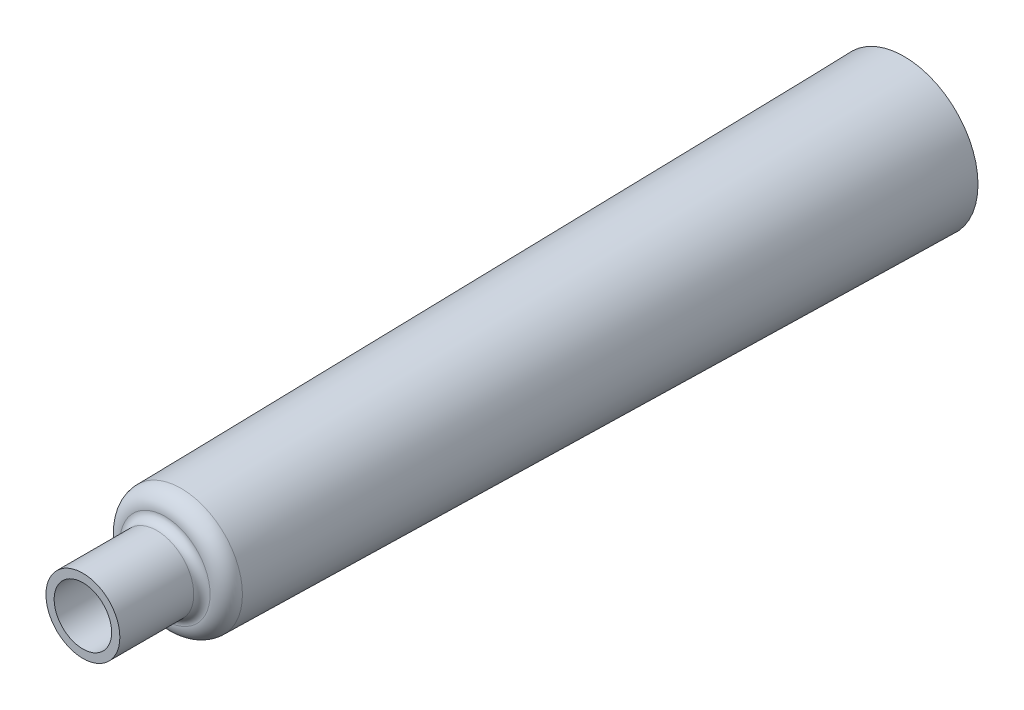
ISO-10303-21;
HEADER;
FILE_DESCRIPTION(('STEP AP214'),'2;1');
FILE_NAME('part.step','',(''),(''),'','','');
FILE_SCHEMA(('AUTOMOTIVE_DESIGN { 1 0 10303 214 1 1 1 1 }'));
ENDSEC;
DATA;
#1=APPLICATION_CONTEXT('core data for automotive mechanical design processes');
#2=APPLICATION_PROTOCOL_DEFINITION('international standard','automotive_design',2000,#1);
#3=PRODUCT_CONTEXT('',#1,'mechanical');
#4=PRODUCT('Part','Part','',(#3));
#5=PRODUCT_RELATED_PRODUCT_CATEGORY('part','',(#4));
#6=PRODUCT_DEFINITION_FORMATION('','',#4);
#7=PRODUCT_DEFINITION_CONTEXT('part definition',#1,'design');
#8=PRODUCT_DEFINITION('design','',#6,#7);
#9=PRODUCT_DEFINITION_SHAPE('','',#8);
#10=(LENGTH_UNIT() NAMED_UNIT(*) SI_UNIT(.MILLI.,.METRE.));
#11=(NAMED_UNIT(*) PLANE_ANGLE_UNIT() SI_UNIT($,.RADIAN.));
#12=(NAMED_UNIT(*) SI_UNIT($,.STERADIAN.) SOLID_ANGLE_UNIT());
#13=UNCERTAINTY_MEASURE_WITH_UNIT(LENGTH_MEASURE(1.E-05),#10,'distance_accuracy_value','');
#14=(GEOMETRIC_REPRESENTATION_CONTEXT(3) GLOBAL_UNCERTAINTY_ASSIGNED_CONTEXT((#13)) GLOBAL_UNIT_ASSIGNED_CONTEXT((#10,
#11,#12)) REPRESENTATION_CONTEXT('',''));
#15=CARTESIAN_POINT('',(0.,0.,0.));
#16=DIRECTION('',(0.,0.,1.));
#17=DIRECTION('',(1.,0.,0.));
#18=AXIS2_PLACEMENT_3D('',#15,#16,#17);
#19=CARTESIAN_POINT('',(0.,0.,0.));
#20=DIRECTION('',(0.,0.,-1.));
#21=DIRECTION('',(1.,0.,0.));
#22=AXIS2_PLACEMENT_3D('',#19,#20,#21);
#23=CONICAL_SURFACE('',#22,9.,0.0174532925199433);
#24=CARTESIAN_POINT('',(0.,0.,88.0349048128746));
#25=DIRECTION('',(0.,0.,-1.));
#26=DIRECTION('',(-1.,0.,0.));
#27=AXIS2_PLACEMENT_3D('',#24,#25,#26);
#28=CIRCLE('',#27,7.46334502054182);
#29=CARTESIAN_POINT('',(-7.46334502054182,0.,88.0349048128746));
#30=VERTEX_POINT('',#29);
#31=EDGE_CURVE('E41',#30,#30,#28,.T.);
#32=ORIENTED_EDGE('',*,*,#31,.T.);
#33=EDGE_LOOP('',(#32));
#34=FACE_BOUND('',#33,.T.);
#35=CARTESIAN_POINT('',(0.,0.,0.));
#36=DIRECTION('',(0.,0.,1.));
#37=DIRECTION('',(1.,0.,0.));
#38=AXIS2_PLACEMENT_3D('',#35,#36,#37);
#39=CIRCLE('',#38,9.);
#40=CARTESIAN_POINT('',(9.,0.,0.));
#41=VERTEX_POINT('',#40);
#42=EDGE_CURVE('E45',#41,#41,#39,.T.);
#43=ORIENTED_EDGE('',*,*,#42,.T.);
#44=EDGE_LOOP('',(#43));
#45=FACE_BOUND('',#44,.T.);
#46=ADVANCED_FACE('F30',(#34,#45),#23,.T.);
#47=CARTESIAN_POINT('',(0.,0.,0.));
#48=DIRECTION('',(0.,0.,1.));
#49=DIRECTION('',(1.,0.,0.));
#50=AXIS2_PLACEMENT_3D('',#47,#48,#49);
#51=PLANE('',#50);
#52=ORIENTED_EDGE('',*,*,#42,.F.);
#53=EDGE_LOOP('',(#52));
#54=FACE_BOUND('',#53,.T.);
#55=ADVANCED_FACE('F87',(#54),#51,.F.);
#56=CARTESIAN_POINT('',(0.,0.,100.));
#57=DIRECTION('',(0.,0.,-1.));
#58=DIRECTION('',(-1.,0.,0.));
#59=AXIS2_PLACEMENT_3D('',#56,#57,#58);
#60=CYLINDRICAL_SURFACE('',#59,4.5);
#61=CARTESIAN_POINT('',(0.,0.,90.9997797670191));
#62=DIRECTION('',(0.,0.,1.));
#63=DIRECTION('',(1.,0.,0.));
#64=AXIS2_PLACEMENT_3D('',#61,#62,#63);
#65=CIRCLE('',#64,4.5);
#66=CARTESIAN_POINT('',(4.5,0.,90.9997797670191));
#67=VERTEX_POINT('',#66);
#68=EDGE_CURVE('E37',#67,#67,#65,.T.);
#69=ORIENTED_EDGE('',*,*,#68,.T.);
#70=EDGE_LOOP('',(#69));
#71=FACE_BOUND('',#70,.T.);
#72=CARTESIAN_POINT('',(0.,0.,100.));
#73=DIRECTION('',(0.,0.,1.));
#74=DIRECTION('',(1.,0.,0.));
#75=AXIS2_PLACEMENT_3D('',#72,#73,#74);
#76=CIRCLE('',#75,4.5);
#77=CARTESIAN_POINT('',(4.5,0.,100.));
#78=VERTEX_POINT('',#77);
#79=EDGE_CURVE('E50',#78,#78,#76,.T.);
#80=ORIENTED_EDGE('',*,*,#79,.F.);
#81=EDGE_LOOP('',(#80));
#82=FACE_BOUND('',#81,.T.);
#83=ADVANCED_FACE('F93',(#71,#82),#60,.T.);
#84=CARTESIAN_POINT('',(0.,0.,100.));
#85=DIRECTION('',(0.,0.,1.));
#86=DIRECTION('',(1.,0.,0.));
#87=AXIS2_PLACEMENT_3D('',#84,#85,#86);
#88=PLANE('',#87);
#89=CARTESIAN_POINT('',(0.,0.,100.));
#90=DIRECTION('',(0.,0.,1.));
#91=DIRECTION('',(1.,0.,0.));
#92=AXIS2_PLACEMENT_3D('',#89,#90,#91);
#93=CIRCLE('',#92,3.5);
#94=CARTESIAN_POINT('',(3.5,0.,100.));
#95=VERTEX_POINT('',#94);
#96=EDGE_CURVE('E54',#95,#95,#93,.T.);
#97=ORIENTED_EDGE('',*,*,#96,.F.);
#98=EDGE_LOOP('',(#97));
#99=FACE_BOUND('',#98,.T.);
#100=ORIENTED_EDGE('',*,*,#79,.T.);
#101=EDGE_LOOP('',(#100));
#102=FACE_BOUND('',#101,.T.);
#103=ADVANCED_FACE('F100',(#99,#102),#88,.T.);
#104=CARTESIAN_POINT('',(0.,0.,88.));
#105=DIRECTION('',(0.,0.,1.));
#106=DIRECTION('',(1.,0.,0.));
#107=AXIS2_PLACEMENT_3D('',#104,#105,#106);
#108=TOROIDAL_SURFACE('',#107,5.46364963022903,2.);
#109=CARTESIAN_POINT('',(0.,0.,89.9998531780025));
#110=DIRECTION('',(0.,0.,-1.));
#111=DIRECTION('',(-1.,0.,0.));
#112=AXIS2_PLACEMENT_3D('',#109,#110,#111);
#113=CIRCLE('',#112,5.48788321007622);
#114=CARTESIAN_POINT('',(-5.48788321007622,0.,89.9998531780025));
#115=VERTEX_POINT('',#114);
#116=EDGE_CURVE('E10',#115,#115,#113,.T.);
#117=ORIENTED_EDGE('',*,*,#116,.T.);
#118=EDGE_LOOP('',(#117));
#119=FACE_BOUND('',#118,.T.);
#120=ORIENTED_EDGE('',*,*,#31,.F.);
#121=EDGE_LOOP('',(#120));
#122=FACE_BOUND('',#121,.T.);
#123=ADVANCED_FACE('F98',(#119,#122),#108,.T.);
#124=CARTESIAN_POINT('',(0.,0.,90.9997797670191));
#125=DIRECTION('',(0.,0.,1.));
#126=DIRECTION('',(1.,0.,0.));
#127=AXIS2_PLACEMENT_3D('',#124,#125,#126);
#128=TOROIDAL_SURFACE('',#127,5.5,1.);
#129=ORIENTED_EDGE('',*,*,#116,.F.);
#130=EDGE_LOOP('',(#129));
#131=FACE_BOUND('',#130,.T.);
#132=ORIENTED_EDGE('',*,*,#68,.F.);
#133=EDGE_LOOP('',(#132));
#134=FACE_BOUND('',#133,.T.);
#135=ADVANCED_FACE('F32',(#131,#134),#128,.F.);
#136=CARTESIAN_POINT('',(0.,0.,-0.0174524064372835));
#137=DIRECTION('',(0.,0.,-1.));
#138=DIRECTION('',(1.,0.,0.));
#139=AXIS2_PLACEMENT_3D('',#136,#137,#138);
#140=CONICAL_SURFACE('',#139,8.00015230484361,0.0174532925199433);
#141=CARTESIAN_POINT('',(0.,0.,88.0174524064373));
#142=DIRECTION('',(0.,0.,-1.));
#143=DIRECTION('',(-1.,0.,0.));
#144=AXIS2_PLACEMENT_3D('',#141,#142,#143);
#145=CIRCLE('',#144,6.46349732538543);
#146=CARTESIAN_POINT('',(-6.46349732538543,0.,88.0174524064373));
#147=VERTEX_POINT('',#146);
#148=EDGE_CURVE('E61',#147,#147,#145,.T.);
#149=ORIENTED_EDGE('',*,*,#148,.F.);
#150=EDGE_LOOP('',(#149));
#151=FACE_BOUND('',#150,.T.);
#152=CARTESIAN_POINT('',(0.,0.,1.));
#153=DIRECTION('',(0.,0.,1.));
#154=DIRECTION('',(1.,0.,0.));
#155=AXIS2_PLACEMENT_3D('',#152,#153,#154);
#156=CIRCLE('',#155,7.98239260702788);
#157=CARTESIAN_POINT('',(7.98239260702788,0.,1.));
#158=VERTEX_POINT('',#157);
#159=EDGE_CURVE('E57',#158,#158,#156,.T.);
#160=ORIENTED_EDGE('',*,*,#159,.F.);
#161=EDGE_LOOP('',(#160));
#162=FACE_BOUND('',#161,.T.);
#163=ADVANCED_FACE('F71',(#151,#162),#140,.F.);
#164=CARTESIAN_POINT('',(0.,0.,1.));
#165=DIRECTION('',(0.,0.,1.));
#166=DIRECTION('',(1.,0.,0.));
#167=AXIS2_PLACEMENT_3D('',#164,#165,#166);
#168=PLANE('',#167);
#169=ORIENTED_EDGE('',*,*,#159,.T.);
#170=EDGE_LOOP('',(#169));
#171=FACE_BOUND('',#170,.T.);
#172=ADVANCED_FACE('F74',(#171),#168,.T.);
#173=CARTESIAN_POINT('',(0.,0.,100.));
#174=DIRECTION('',(0.,0.,-1.));
#175=DIRECTION('',(-1.,0.,0.));
#176=AXIS2_PLACEMENT_3D('',#173,#174,#175);
#177=CYLINDRICAL_SURFACE('',#176,3.5);
#178=CARTESIAN_POINT('',(0.,0.,90.9997797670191));
#179=DIRECTION('',(0.,0.,-1.));
#180=DIRECTION('',(-1.,0.,0.));
#181=AXIS2_PLACEMENT_3D('',#178,#179,#180);
#182=CIRCLE('',#181,3.5);
#183=CARTESIAN_POINT('',(-3.5,0.,90.9997797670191));
#184=VERTEX_POINT('',#183);
#185=EDGE_CURVE('E58',#184,#184,#182,.F.);
#186=ORIENTED_EDGE('',*,*,#185,.F.);
#187=EDGE_LOOP('',(#186));
#188=FACE_BOUND('',#187,.T.);
#189=ORIENTED_EDGE('',*,*,#96,.T.);
#190=EDGE_LOOP('',(#189));
#191=FACE_BOUND('',#190,.T.);
#192=ADVANCED_FACE('F79',(#188,#191),#177,.F.);
#193=CARTESIAN_POINT('',(0.,0.,88.));
#194=DIRECTION('',(0.,0.,1.));
#195=DIRECTION('',(1.,0.,0.));
#196=AXIS2_PLACEMENT_3D('',#193,#194,#195);
#197=TOROIDAL_SURFACE('',#196,5.46364963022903,1.);
#198=CARTESIAN_POINT('',(0.,0.,88.9999265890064));
#199=DIRECTION('',(0.,0.,1.));
#200=DIRECTION('',(1.,0.,0.));
#201=AXIS2_PLACEMENT_3D('',#198,#199,#200);
#202=CIRCLE('',#201,5.47576642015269);
#203=CARTESIAN_POINT('',(5.47576642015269,0.,88.9999265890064));
#204=VERTEX_POINT('',#203);
#205=EDGE_CURVE('E53',#204,#204,#202,.F.);
#206=ORIENTED_EDGE('',*,*,#205,.F.);
#207=EDGE_LOOP('',(#206));
#208=FACE_BOUND('',#207,.T.);
#209=ORIENTED_EDGE('',*,*,#148,.T.);
#210=EDGE_LOOP('',(#209));
#211=FACE_BOUND('',#210,.T.);
#212=ADVANCED_FACE('F69',(#208,#211),#197,.F.);
#213=CARTESIAN_POINT('',(0.,0.,90.9997797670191));
#214=DIRECTION('',(0.,0.,1.));
#215=DIRECTION('',(1.,0.,0.));
#216=AXIS2_PLACEMENT_3D('',#213,#214,#215);
#217=TOROIDAL_SURFACE('',#216,5.5,2.);
#218=ORIENTED_EDGE('',*,*,#205,.T.);
#219=EDGE_LOOP('',(#218));
#220=FACE_BOUND('',#219,.T.);
#221=ORIENTED_EDGE('',*,*,#185,.T.);
#222=EDGE_LOOP('',(#221));
#223=FACE_BOUND('',#222,.T.);
#224=ADVANCED_FACE('F116',(#220,#223),#217,.T.);
#225=CLOSED_SHELL('',(#46,#55,#83,#103,#123,#135,#163,#172,#192,#212,#224));
#226=MANIFOLD_SOLID_BREP('B2',#225);
#227=ADVANCED_BREP_SHAPE_REPRESENTATION('',(#18,#226),#14);
#228=SHAPE_DEFINITION_REPRESENTATION(#9,#227);
ENDSEC;
END-ISO-10303-21;
